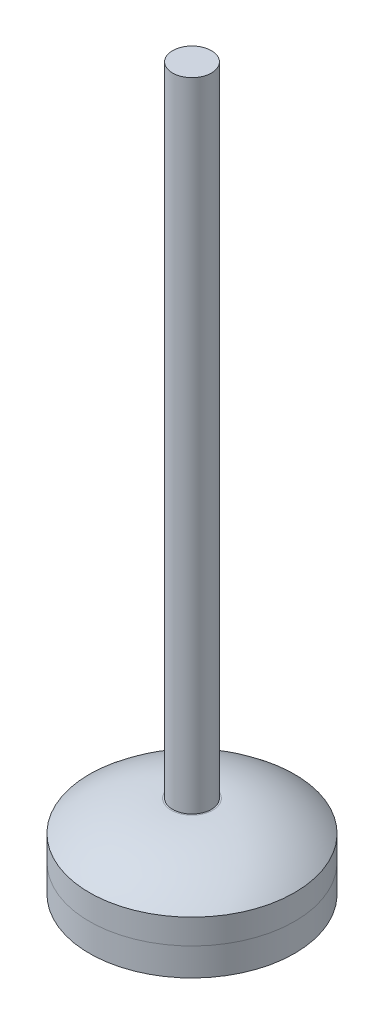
from build123d import *

# Parameters (mm, degrees)
ESQUISSE2_R      = 7
EXTRUSION1_DEPTH = 230
ESQUISSE3_R      = 37
EXTRUSION2_DEPTH = 10


with BuildPart() as part:
    # Esquisse1 → R_volution1 (revolve)
    with BuildSketch(Plane.XY, mode=Mode.PRIVATE) as r_volution1_sk:
        with BuildLine():
            Line((0, 0), (37, 0))
            Line((37, 0), (37, 9))
            ThreePointArc((37, 9), (23.242061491, 17.160528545), (7.5, 20))
            Line((7.5, 20), (0, 20))
            Line((0, 20), (0, 0))
        make_face()
    revolve(r_volution1_sk.sketch.rotate(Axis((0, 20, 0), (0, -1, 0)), 180), axis=Axis((0, 20, 0), (0, -1, 0)))

    # Esquisse2 → Extrusion1 (add)
    with BuildSketch(Plane(origin=(0, 20, 0), x_dir=(-1, 0, 0), z_dir=(0, 1, 0))):
        with Locations(Location((0, 0, 0), (0, 0, 180))):
            Circle(ESQUISSE2_R)
    extrude(amount=EXTRUSION1_DEPTH)


with BuildPart() as body_2:
    # Esquisse3 → Extrusion2 (new body)
    with BuildSketch(Plane.XZ):
        Circle(ESQUISSE3_R)
    extrude(amount=EXTRUSION2_DEPTH)


solid = Compound([part.part, body_2.part])
